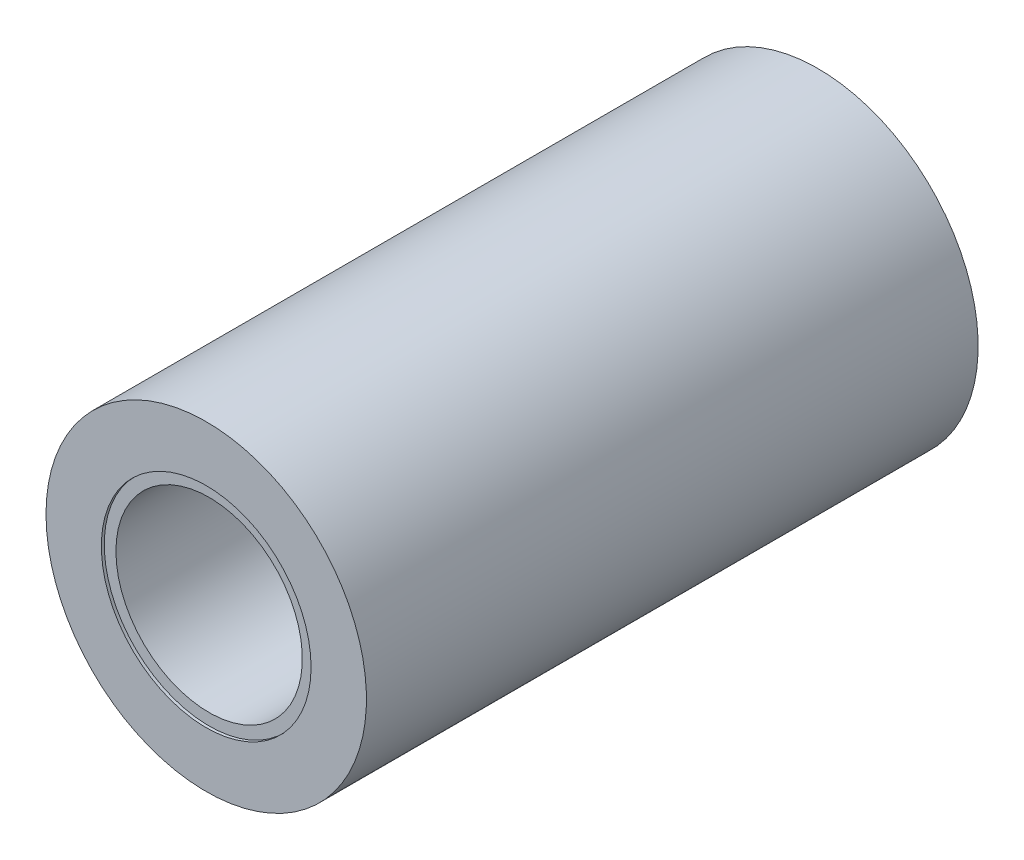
from build123d import *

# Parameters (mm, degrees)
ESQUISSE1_R             = 5.5
ESQUISSE1_R_2           = 3.2
BOSS_EXTRU_1_DEPTH      = 10.5
ESQUISSE2_R             = 3.6
ENL_V_MAT_EXTRU_1_DEPTH = 0.1
ENL_V_START             = -0.1
ESQUISSE3_R             = 3.6
ENL_V_MAT_EXTRU_2_DEPTH = 0.1


with BuildPart() as part:
    # Esquisse1 → Boss.-Extru.1 (new, symmetric)
    with BuildSketch(Plane.XY):
        with Locations(Location((0, 0, 0), (0, 0, 180))):
            Circle(ESQUISSE1_R)
        with Locations(Location((0, 0, 0), (0, 0, 180))):
            Circle(ESQUISSE1_R_2, mode=Mode.SUBTRACT)
    extrude(amount=BOSS_EXTRU_1_DEPTH, both=True)

    # Esquisse2 → Enl_v. mat.-Extru.1 (cut)
    with BuildSketch(Plane.XY.offset(10.5)):
        Circle(ESQUISSE2_R)
    extrude(amount=-ENL_V_MAT_EXTRU_1_DEPTH, mode=Mode.SUBTRACT)

    # Esquisse3 → Enl_v. mat.-Extru.2 (cut)
    with BuildSketch(Plane(origin=(0, 0, -10.5), x_dir=(-1, 0, 0), z_dir=(0, 0, -1)).offset(ENL_V_START)):
        with Locations(Location((0, 0, 0), (0, 0, 180))):
            Circle(ESQUISSE3_R)
    extrude(amount=ENL_V_MAT_EXTRU_2_DEPTH, mode=Mode.SUBTRACT)


solid = part.part
